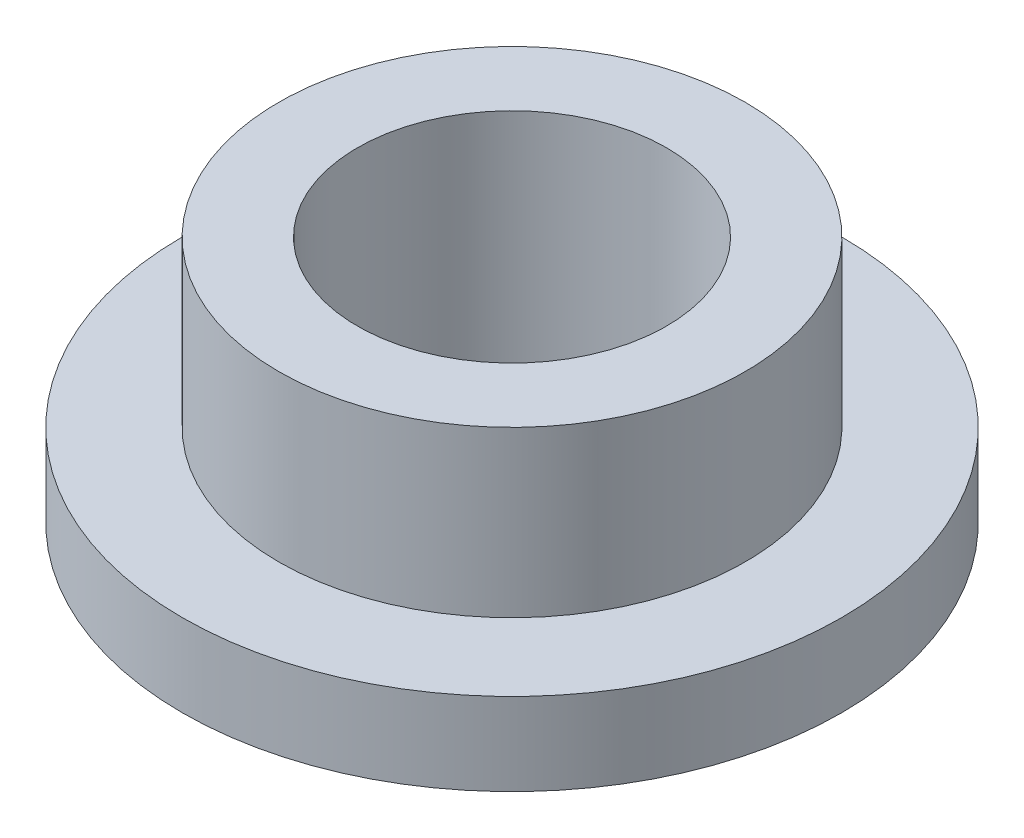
from build123d import *


with BuildPart() as part:
    # Sketch1 → Revolve1 (revolve)
    with BuildSketch(Plane.XY, mode=Mode.PRIVATE) as revolve1_sk:
        Polygon((2.38125, 0), (5.08, 0), (5.08, 1.27), (3.5941, 1.27), (3.5941, 3.81), (2.38125, 3.81), align=None)
    revolve(revolve1_sk.sketch.rotate(Axis((0, 0, 0), (0, 1, 0)), 90), axis=Axis((0, 0, 0), (0, 1, 0)))


solid = part.part
